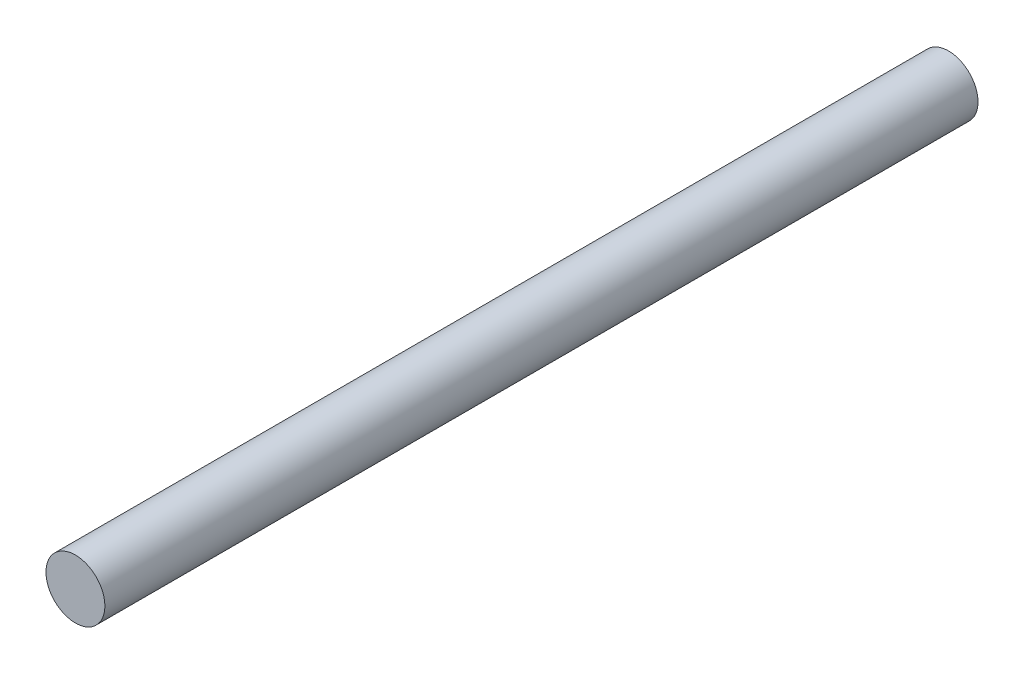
ISO-10303-21;
HEADER;
FILE_DESCRIPTION(('STEP AP214'),'2;1');
FILE_NAME('part.step','',(''),(''),'','','');
FILE_SCHEMA(('AUTOMOTIVE_DESIGN { 1 0 10303 214 1 1 1 1 }'));
ENDSEC;
DATA;
#1=APPLICATION_CONTEXT('core data for automotive mechanical design processes');
#2=APPLICATION_PROTOCOL_DEFINITION('international standard','automotive_design',2000,#1);
#3=PRODUCT_CONTEXT('',#1,'mechanical');
#4=PRODUCT('Part','Part','',(#3));
#5=PRODUCT_RELATED_PRODUCT_CATEGORY('part','',(#4));
#6=PRODUCT_DEFINITION_FORMATION('','',#4);
#7=PRODUCT_DEFINITION_CONTEXT('part definition',#1,'design');
#8=PRODUCT_DEFINITION('design','',#6,#7);
#9=PRODUCT_DEFINITION_SHAPE('','',#8);
#10=(LENGTH_UNIT() NAMED_UNIT(*) SI_UNIT(.MILLI.,.METRE.));
#11=(NAMED_UNIT(*) PLANE_ANGLE_UNIT() SI_UNIT($,.RADIAN.));
#12=(NAMED_UNIT(*) SI_UNIT($,.STERADIAN.) SOLID_ANGLE_UNIT());
#13=UNCERTAINTY_MEASURE_WITH_UNIT(LENGTH_MEASURE(1.E-05),#10,'distance_accuracy_value','');
#14=(GEOMETRIC_REPRESENTATION_CONTEXT(3) GLOBAL_UNCERTAINTY_ASSIGNED_CONTEXT((#13)) GLOBAL_UNIT_ASSIGNED_CONTEXT((#10,
#11,#12)) REPRESENTATION_CONTEXT('',''));
#15=CARTESIAN_POINT('',(0.,0.,0.));
#16=DIRECTION('',(0.,0.,1.));
#17=DIRECTION('',(1.,0.,0.));
#18=AXIS2_PLACEMENT_3D('',#15,#16,#17);
#19=CARTESIAN_POINT('',(-2.05590358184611,-3.8735,2.54));
#20=DIRECTION('',(0.,0.,-1.));
#21=DIRECTION('',(-1.,0.,0.));
#22=AXIS2_PLACEMENT_3D('',#19,#20,#21);
#23=CYLINDRICAL_SURFACE('',#22,0.6858);
#24=CARTESIAN_POINT('',(-2.05590358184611,-3.8735,2.54));
#25=DIRECTION('',(0.,0.,1.));
#26=DIRECTION('',(1.,0.,0.));
#27=AXIS2_PLACEMENT_3D('',#24,#25,#26);
#28=CIRCLE('',#27,0.6858);
#29=CARTESIAN_POINT('',(-1.37010358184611,-3.8735,2.54));
#30=VERTEX_POINT('',#29);
#31=EDGE_CURVE('E10',#30,#30,#28,.T.);
#32=ORIENTED_EDGE('',*,*,#31,.F.);
#33=EDGE_LOOP('',(#32));
#34=FACE_BOUND('',#33,.T.);
#35=CARTESIAN_POINT('',(-2.05590358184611,-3.8735,-17.78));
#36=DIRECTION('',(0.,0.,1.));
#37=DIRECTION('',(1.,0.,0.));
#38=AXIS2_PLACEMENT_3D('',#35,#36,#37);
#39=CIRCLE('',#38,0.6858);
#40=CARTESIAN_POINT('',(-1.37010358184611,-3.8735,-17.78));
#41=VERTEX_POINT('',#40);
#42=EDGE_CURVE('E39',#41,#41,#39,.T.);
#43=ORIENTED_EDGE('',*,*,#42,.T.);
#44=EDGE_LOOP('',(#43));
#45=FACE_BOUND('',#44,.T.);
#46=ADVANCED_FACE('F33',(#34,#45),#23,.T.);
#47=CARTESIAN_POINT('',(-2.05590358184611,-3.8735,2.54));
#48=DIRECTION('',(0.,0.,1.));
#49=DIRECTION('',(1.,0.,0.));
#50=AXIS2_PLACEMENT_3D('',#47,#48,#49);
#51=PLANE('',#50);
#52=ORIENTED_EDGE('',*,*,#31,.T.);
#53=EDGE_LOOP('',(#52));
#54=FACE_BOUND('',#53,.T.);
#55=ADVANCED_FACE('F48',(#54),#51,.T.);
#56=CARTESIAN_POINT('',(-2.05590358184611,-3.8735,-17.78));
#57=DIRECTION('',(0.,0.,1.));
#58=DIRECTION('',(1.,0.,0.));
#59=AXIS2_PLACEMENT_3D('',#56,#57,#58);
#60=PLANE('',#59);
#61=ORIENTED_EDGE('',*,*,#42,.F.);
#62=EDGE_LOOP('',(#61));
#63=FACE_BOUND('',#62,.T.);
#64=ADVANCED_FACE('F46',(#63),#60,.F.);
#65=CLOSED_SHELL('',(#46,#55,#64));
#66=MANIFOLD_SOLID_BREP('B2',#65);
#67=ADVANCED_BREP_SHAPE_REPRESENTATION('',(#18,#66),#14);
#68=SHAPE_DEFINITION_REPRESENTATION(#9,#67);
ENDSEC;
END-ISO-10303-21;
